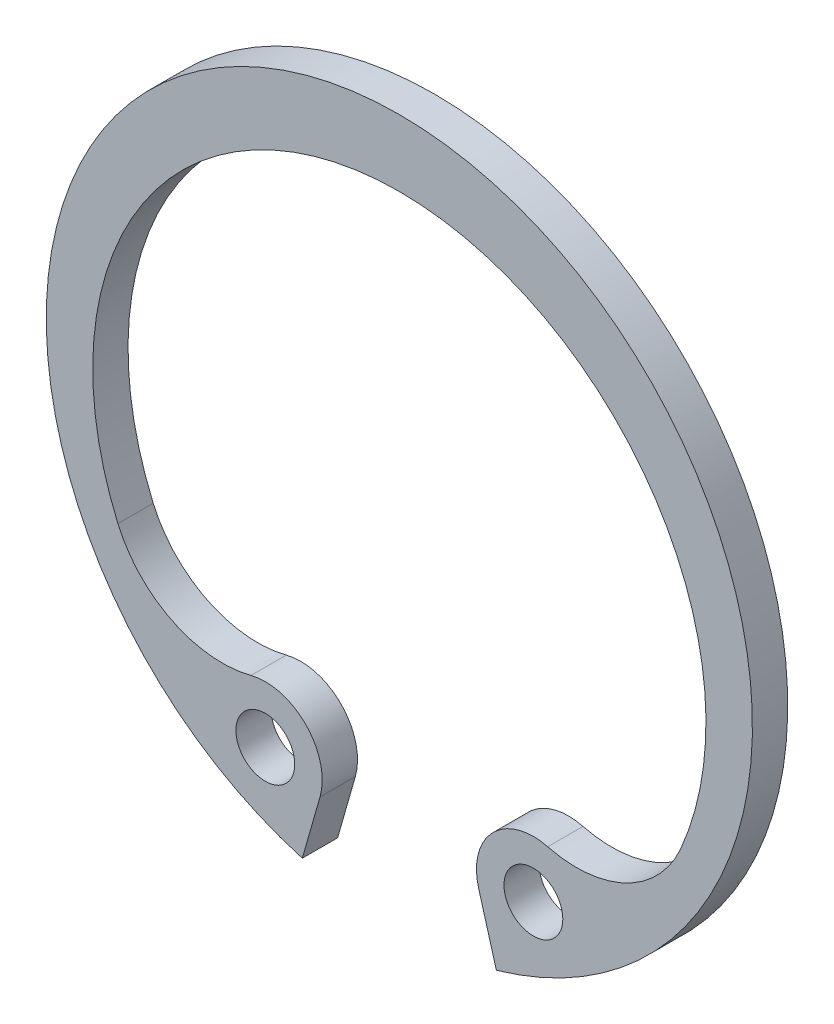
ISO-10303-21;
HEADER;
FILE_DESCRIPTION(('STEP AP214'),'2;1');
FILE_NAME('part.step','',(''),(''),'','','');
FILE_SCHEMA(('AUTOMOTIVE_DESIGN { 1 0 10303 214 1 1 1 1 }'));
ENDSEC;
DATA;
#1=APPLICATION_CONTEXT('core data for automotive mechanical design processes');
#2=APPLICATION_PROTOCOL_DEFINITION('international standard','automotive_design',2000,#1);
#3=PRODUCT_CONTEXT('',#1,'mechanical');
#4=PRODUCT('Part','Part','',(#3));
#5=PRODUCT_RELATED_PRODUCT_CATEGORY('part','',(#4));
#6=PRODUCT_DEFINITION_FORMATION('','',#4);
#7=PRODUCT_DEFINITION_CONTEXT('part definition',#1,'design');
#8=PRODUCT_DEFINITION('design','',#6,#7);
#9=PRODUCT_DEFINITION_SHAPE('','',#8);
#10=(LENGTH_UNIT() NAMED_UNIT(*) SI_UNIT(.MILLI.,.METRE.));
#11=(NAMED_UNIT(*) PLANE_ANGLE_UNIT() SI_UNIT($,.RADIAN.));
#12=(NAMED_UNIT(*) SI_UNIT($,.STERADIAN.) SOLID_ANGLE_UNIT());
#13=UNCERTAINTY_MEASURE_WITH_UNIT(LENGTH_MEASURE(1.E-05),#10,'distance_accuracy_value','');
#14=(GEOMETRIC_REPRESENTATION_CONTEXT(3) GLOBAL_UNCERTAINTY_ASSIGNED_CONTEXT((#13)) GLOBAL_UNIT_ASSIGNED_CONTEXT((#10,
#11,#12)) REPRESENTATION_CONTEXT('',''));
#15=CARTESIAN_POINT('',(0.,0.,0.));
#16=DIRECTION('',(0.,0.,1.));
#17=DIRECTION('',(1.,0.,0.));
#18=AXIS2_PLACEMENT_3D('',#15,#16,#17);
#19=CARTESIAN_POINT('',(0.,0.,-0.900000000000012));
#20=DIRECTION('',(0.,0.,1.));
#21=DIRECTION('',(1.,0.,0.));
#22=AXIS2_PLACEMENT_3D('',#19,#20,#21);
#23=CYLINDRICAL_SURFACE('',#22,9.);
#24=CARTESIAN_POINT('',(0.,0.,0.));
#25=DIRECTION('',(0.,0.,1.));
#26=DIRECTION('',(1.,0.,0.));
#27=AXIS2_PLACEMENT_3D('',#24,#25,#26);
#28=CIRCLE('',#27,9.);
#29=CARTESIAN_POINT('',(2.47318552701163,-8.65351681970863,0.));
#30=VERTEX_POINT('',#29);
#31=CARTESIAN_POINT('',(-2.47318552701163,-8.65351681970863,0.));
#32=VERTEX_POINT('',#31);
#33=EDGE_CURVE('E98',#30,#32,#28,.T.);
#34=ORIENTED_EDGE('',*,*,#33,.F.);
#35=DIRECTION('',(0.,0.,1.));
#36=VECTOR('',#35,1.);
#37=CARTESIAN_POINT('',(2.47318552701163,-8.65351681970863,-0.900000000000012));
#38=LINE('',#37,#36);
#39=CARTESIAN_POINT('',(2.47318552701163,-8.65351681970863,-0.900000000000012));
#40=VERTEX_POINT('',#39);
#41=EDGE_CURVE('E11',#40,#30,#38,.T.);
#42=ORIENTED_EDGE('',*,*,#41,.F.);
#43=CARTESIAN_POINT('',(0.,0.,-0.900000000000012));
#44=DIRECTION('',(0.,0.,1.));
#45=DIRECTION('',(1.,0.,0.));
#46=AXIS2_PLACEMENT_3D('',#43,#44,#45);
#47=CIRCLE('',#46,9.);
#48=CARTESIAN_POINT('',(-2.47318552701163,-8.65351681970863,-0.900000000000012));
#49=VERTEX_POINT('',#48);
#50=EDGE_CURVE('E100',#40,#49,#47,.T.);
#51=ORIENTED_EDGE('',*,*,#50,.T.);
#52=DIRECTION('',(0.,0.,1.));
#53=VECTOR('',#52,1.);
#54=CARTESIAN_POINT('',(-2.47318552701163,-8.65351681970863,-0.900000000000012));
#55=LINE('',#54,#53);
#56=EDGE_CURVE('E37',#49,#32,#55,.T.);
#57=ORIENTED_EDGE('',*,*,#56,.T.);
#58=EDGE_LOOP('',(#34,#42,#51,#57));
#59=FACE_BOUND('',#58,.T.);
#60=ADVANCED_FACE('F34',(#59),#23,.T.);
#61=CARTESIAN_POINT('',(2.47318552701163,-8.65351681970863,-0.900000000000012));
#62=DIRECTION('',(-0.961501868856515,-0.274798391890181,0.));
#63=DIRECTION('',(0.274798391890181,-0.961501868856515,0.));
#64=AXIS2_PLACEMENT_3D('',#61,#62,#63);
#65=PLANE('',#64);
#66=DIRECTION('',(0.274798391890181,-0.961501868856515,0.));
#67=VECTOR('',#66,1.);
#68=CARTESIAN_POINT('',(2.47318552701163,-8.65351681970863,0.));
#69=LINE('',#68,#67);
#70=CARTESIAN_POINT('',(2.02210355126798,-7.07521004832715,0.));
#71=VERTEX_POINT('',#70);
#72=EDGE_CURVE('E116',#71,#30,#69,.T.);
#73=ORIENTED_EDGE('',*,*,#72,.F.);
#74=DIRECTION('',(0.,0.,1.));
#75=VECTOR('',#74,1.);
#76=CARTESIAN_POINT('',(2.02210355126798,-7.07521004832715,-0.900000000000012));
#77=LINE('',#76,#75);
#78=CARTESIAN_POINT('',(2.02210355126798,-7.07521004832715,-0.900000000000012));
#79=VERTEX_POINT('',#78);
#80=EDGE_CURVE('E42',#79,#71,#77,.T.);
#81=ORIENTED_EDGE('',*,*,#80,.F.);
#82=DIRECTION('',(0.274798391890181,-0.961501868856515,0.));
#83=VECTOR('',#82,1.);
#84=CARTESIAN_POINT('',(2.47318552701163,-8.65351681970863,-0.900000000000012));
#85=LINE('',#84,#83);
#86=EDGE_CURVE('E105',#79,#40,#85,.T.);
#87=ORIENTED_EDGE('',*,*,#86,.T.);
#88=ORIENTED_EDGE('',*,*,#41,.T.);
#89=EDGE_LOOP('',(#73,#81,#87,#88));
#90=FACE_BOUND('',#89,.T.);
#91=ADVANCED_FACE('F182',(#90),#65,.T.);
#92=CARTESIAN_POINT('',(3.41628126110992,-6.67675238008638,-0.900000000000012));
#93=DIRECTION('',(0.,0.,1.));
#94=DIRECTION('',(1.,0.,0.));
#95=AXIS2_PLACEMENT_3D('',#92,#93,#94);
#96=CYLINDRICAL_SURFACE('',#95,1.45);
#97=CARTESIAN_POINT('',(3.41628126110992,-6.67675238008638,0.));
#98=DIRECTION('',(0.,0.,1.));
#99=DIRECTION('',(1.,0.,0.));
#100=AXIS2_PLACEMENT_3D('',#97,#98,#99);
#101=CIRCLE('',#100,1.45);
#102=CARTESIAN_POINT('',(3.78146677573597,-5.27349205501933,0.));
#103=VERTEX_POINT('',#102);
#104=EDGE_CURVE('E134',#103,#71,#101,.T.);
#105=ORIENTED_EDGE('',*,*,#104,.F.);
#106=DIRECTION('',(0.,0.,1.));
#107=VECTOR('',#106,1.);
#108=CARTESIAN_POINT('',(3.78146677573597,-5.27349205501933,-0.900000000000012));
#109=LINE('',#108,#107);
#110=CARTESIAN_POINT('',(3.78146677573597,-5.27349205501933,-0.900000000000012));
#111=VERTEX_POINT('',#110);
#112=EDGE_CURVE('E156',#111,#103,#109,.T.);
#113=ORIENTED_EDGE('',*,*,#112,.F.);
#114=CARTESIAN_POINT('',(3.41628126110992,-6.67675238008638,-0.900000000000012));
#115=DIRECTION('',(0.,0.,1.));
#116=DIRECTION('',(1.,0.,0.));
#117=AXIS2_PLACEMENT_3D('',#114,#115,#116);
#118=CIRCLE('',#117,1.45);
#119=EDGE_CURVE('E152',#111,#79,#118,.T.);
#120=ORIENTED_EDGE('',*,*,#119,.T.);
#121=ORIENTED_EDGE('',*,*,#80,.T.);
#122=EDGE_LOOP('',(#105,#113,#120,#121));
#123=FACE_BOUND('',#122,.T.);
#124=ADVANCED_FACE('F181',(#123),#96,.T.);
#125=CARTESIAN_POINT('',(4.51183780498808,-2.46697140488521,-0.900000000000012));
#126=DIRECTION('',(0.,0.,1.));
#127=DIRECTION('',(1.,0.,0.));
#128=AXIS2_PLACEMENT_3D('',#125,#126,#127);
#129=CYLINDRICAL_SURFACE('',#128,2.9);
#130=CARTESIAN_POINT('',(4.51183780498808,-2.46697140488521,0.));
#131=DIRECTION('',(0.,0.,-1.));
#132=DIRECTION('',(1.,0.,0.));
#133=AXIS2_PLACEMENT_3D('',#130,#131,#132);
#134=CIRCLE('',#133,2.9);
#135=CARTESIAN_POINT('',(7.17357937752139,-3.61811509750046,0.));
#136=VERTEX_POINT('',#135);
#137=EDGE_CURVE('E131',#136,#103,#134,.T.);
#138=ORIENTED_EDGE('',*,*,#137,.F.);
#139=DIRECTION('',(0.,0.,1.));
#140=VECTOR('',#139,1.);
#141=CARTESIAN_POINT('',(7.17357937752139,-3.61811509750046,-0.900000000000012));
#142=LINE('',#141,#140);
#143=CARTESIAN_POINT('',(7.17357937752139,-3.61811509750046,-0.900000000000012));
#144=VERTEX_POINT('',#143);
#145=EDGE_CURVE('E158',#144,#136,#142,.T.);
#146=ORIENTED_EDGE('',*,*,#145,.F.);
#147=CARTESIAN_POINT('',(4.51183780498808,-2.46697140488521,-0.900000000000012));
#148=DIRECTION('',(0.,0.,-1.));
#149=DIRECTION('',(1.,0.,0.));
#150=AXIS2_PLACEMENT_3D('',#147,#148,#149);
#151=CIRCLE('',#150,2.9);
#152=EDGE_CURVE('E149',#144,#111,#151,.T.);
#153=ORIENTED_EDGE('',*,*,#152,.T.);
#154=ORIENTED_EDGE('',*,*,#112,.T.);
#155=EDGE_LOOP('',(#138,#146,#153,#154));
#156=FACE_BOUND('',#155,.T.);
#157=ADVANCED_FACE('F177',(#156),#129,.F.);
#158=CARTESIAN_POINT('',(0.,-0.515702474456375,-0.900000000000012));
#159=DIRECTION('',(0.,0.,1.));
#160=DIRECTION('',(1.,0.,0.));
#161=AXIS2_PLACEMENT_3D('',#158,#159,#160);
#162=CYLINDRICAL_SURFACE('',#161,7.81570247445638);
#163=CARTESIAN_POINT('',(0.,-0.515702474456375,0.));
#164=DIRECTION('',(0.,0.,-1.));
#165=DIRECTION('',(1.,0.,0.));
#166=AXIS2_PLACEMENT_3D('',#163,#164,#165);
#167=CIRCLE('',#166,7.81570247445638);
#168=CARTESIAN_POINT('',(-7.1735793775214,-3.61811509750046,0.));
#169=VERTEX_POINT('',#168);
#170=EDGE_CURVE('E128',#169,#136,#167,.T.);
#171=ORIENTED_EDGE('',*,*,#170,.F.);
#172=DIRECTION('',(0.,0.,1.));
#173=VECTOR('',#172,1.);
#174=CARTESIAN_POINT('',(-7.1735793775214,-3.61811509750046,-0.900000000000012));
#175=LINE('',#174,#173);
#176=CARTESIAN_POINT('',(-7.1735793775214,-3.61811509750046,-0.900000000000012));
#177=VERTEX_POINT('',#176);
#178=EDGE_CURVE('E160',#177,#169,#175,.T.);
#179=ORIENTED_EDGE('',*,*,#178,.F.);
#180=CARTESIAN_POINT('',(0.,-0.515702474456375,-0.900000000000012));
#181=DIRECTION('',(0.,0.,-1.));
#182=DIRECTION('',(1.,0.,0.));
#183=AXIS2_PLACEMENT_3D('',#180,#181,#182);
#184=CIRCLE('',#183,7.81570247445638);
#185=EDGE_CURVE('E146',#177,#144,#184,.T.);
#186=ORIENTED_EDGE('',*,*,#185,.T.);
#187=ORIENTED_EDGE('',*,*,#145,.T.);
#188=EDGE_LOOP('',(#171,#179,#186,#187));
#189=FACE_BOUND('',#188,.T.);
#190=ADVANCED_FACE('F173',(#189),#162,.F.);
#191=CARTESIAN_POINT('',(-4.51183780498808,-2.46697140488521,-0.900000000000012));
#192=DIRECTION('',(0.,0.,1.));
#193=DIRECTION('',(1.,0.,0.));
#194=AXIS2_PLACEMENT_3D('',#191,#192,#193);
#195=CYLINDRICAL_SURFACE('',#194,2.9);
#196=CARTESIAN_POINT('',(-4.51183780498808,-2.46697140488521,0.));
#197=DIRECTION('',(0.,0.,-1.));
#198=DIRECTION('',(1.,0.,0.));
#199=AXIS2_PLACEMENT_3D('',#196,#197,#198);
#200=CIRCLE('',#199,2.9);
#201=CARTESIAN_POINT('',(-3.78146677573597,-5.27349205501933,0.));
#202=VERTEX_POINT('',#201);
#203=EDGE_CURVE('E125',#202,#169,#200,.T.);
#204=ORIENTED_EDGE('',*,*,#203,.F.);
#205=DIRECTION('',(0.,0.,1.));
#206=VECTOR('',#205,1.);
#207=CARTESIAN_POINT('',(-3.78146677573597,-5.27349205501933,-0.900000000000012));
#208=LINE('',#207,#206);
#209=CARTESIAN_POINT('',(-3.78146677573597,-5.27349205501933,-0.900000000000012));
#210=VERTEX_POINT('',#209);
#211=EDGE_CURVE('E162',#210,#202,#208,.T.);
#212=ORIENTED_EDGE('',*,*,#211,.F.);
#213=CARTESIAN_POINT('',(-4.51183780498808,-2.46697140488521,-0.900000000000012));
#214=DIRECTION('',(0.,0.,-1.));
#215=DIRECTION('',(1.,0.,0.));
#216=AXIS2_PLACEMENT_3D('',#213,#214,#215);
#217=CIRCLE('',#216,2.9);
#218=EDGE_CURVE('E143',#210,#177,#217,.T.);
#219=ORIENTED_EDGE('',*,*,#218,.T.);
#220=ORIENTED_EDGE('',*,*,#178,.T.);
#221=EDGE_LOOP('',(#204,#212,#219,#220));
#222=FACE_BOUND('',#221,.T.);
#223=ADVANCED_FACE('F169',(#222),#195,.F.);
#224=CARTESIAN_POINT('',(-3.41628126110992,-6.67675238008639,-0.900000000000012));
#225=DIRECTION('',(0.,0.,1.));
#226=DIRECTION('',(1.,0.,0.));
#227=AXIS2_PLACEMENT_3D('',#224,#225,#226);
#228=CYLINDRICAL_SURFACE('',#227,1.45);
#229=CARTESIAN_POINT('',(-3.41628126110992,-6.67675238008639,0.));
#230=DIRECTION('',(0.,0.,1.));
#231=DIRECTION('',(1.,0.,0.));
#232=AXIS2_PLACEMENT_3D('',#229,#230,#231);
#233=CIRCLE('',#232,1.45);
#234=CARTESIAN_POINT('',(-2.02210355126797,-7.07521004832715,0.));
#235=VERTEX_POINT('',#234);
#236=EDGE_CURVE('E112',#235,#202,#233,.T.);
#237=ORIENTED_EDGE('',*,*,#236,.F.);
#238=DIRECTION('',(0.,0.,1.));
#239=VECTOR('',#238,1.);
#240=CARTESIAN_POINT('',(-2.02210355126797,-7.07521004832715,-0.900000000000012));
#241=LINE('',#240,#239);
#242=CARTESIAN_POINT('',(-2.02210355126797,-7.07521004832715,-0.900000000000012));
#243=VERTEX_POINT('',#242);
#244=EDGE_CURVE('E104',#243,#235,#241,.T.);
#245=ORIENTED_EDGE('',*,*,#244,.F.);
#246=CARTESIAN_POINT('',(-3.41628126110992,-6.67675238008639,-0.900000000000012));
#247=DIRECTION('',(0.,0.,1.));
#248=DIRECTION('',(1.,0.,0.));
#249=AXIS2_PLACEMENT_3D('',#246,#247,#248);
#250=CIRCLE('',#249,1.45);
#251=EDGE_CURVE('E140',#243,#210,#250,.T.);
#252=ORIENTED_EDGE('',*,*,#251,.T.);
#253=ORIENTED_EDGE('',*,*,#211,.T.);
#254=EDGE_LOOP('',(#237,#245,#252,#253));
#255=FACE_BOUND('',#254,.T.);
#256=ADVANCED_FACE('F165',(#255),#228,.T.);
#257=CARTESIAN_POINT('',(-2.47318552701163,-8.65351681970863,-0.900000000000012));
#258=DIRECTION('',(0.961501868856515,-0.274798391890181,0.));
#259=DIRECTION('',(0.274798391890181,0.961501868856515,0.));
#260=AXIS2_PLACEMENT_3D('',#257,#258,#259);
#261=PLANE('',#260);
#262=DIRECTION('',(0.274798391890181,0.961501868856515,0.));
#263=VECTOR('',#262,1.);
#264=CARTESIAN_POINT('',(-2.47318552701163,-8.65351681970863,0.));
#265=LINE('',#264,#263);
#266=EDGE_CURVE('E107',#32,#235,#265,.T.);
#267=ORIENTED_EDGE('',*,*,#266,.F.);
#268=ORIENTED_EDGE('',*,*,#56,.F.);
#269=DIRECTION('',(0.274798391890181,0.961501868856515,0.));
#270=VECTOR('',#269,1.);
#271=CARTESIAN_POINT('',(-2.47318552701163,-8.65351681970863,-0.900000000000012));
#272=LINE('',#271,#270);
#273=EDGE_CURVE('E138',#49,#243,#272,.T.);
#274=ORIENTED_EDGE('',*,*,#273,.T.);
#275=ORIENTED_EDGE('',*,*,#244,.T.);
#276=EDGE_LOOP('',(#267,#268,#274,#275));
#277=FACE_BOUND('',#276,.T.);
#278=ADVANCED_FACE('F108',(#277),#261,.T.);
#279=CARTESIAN_POINT('',(0.,0.,-0.900000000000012));
#280=DIRECTION('',(0.,0.,1.));
#281=DIRECTION('',(1.,0.,0.));
#282=AXIS2_PLACEMENT_3D('',#279,#280,#281);
#283=PLANE('',#282);
#284=CARTESIAN_POINT('',(-3.41628126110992,-6.67675238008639,-0.900000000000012));
#285=DIRECTION('',(0.,0.,1.));
#286=DIRECTION('',(1.,0.,0.));
#287=AXIS2_PLACEMENT_3D('',#284,#285,#286);
#288=CIRCLE('',#287,0.750000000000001);
#289=CARTESIAN_POINT('',(-2.66628126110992,-6.67675238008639,-0.900000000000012));
#290=VERTEX_POINT('',#289);
#291=EDGE_CURVE('E248',#290,#290,#288,.T.);
#292=ORIENTED_EDGE('',*,*,#291,.T.);
#293=EDGE_LOOP('',(#292));
#294=FACE_BOUND('',#293,.T.);
#295=CARTESIAN_POINT('',(3.41628126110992,-6.67675238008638,-0.900000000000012));
#296=DIRECTION('',(0.,0.,1.));
#297=DIRECTION('',(1.,0.,0.));
#298=AXIS2_PLACEMENT_3D('',#295,#296,#297);
#299=CIRCLE('',#298,0.749999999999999);
#300=CARTESIAN_POINT('',(4.16628126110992,-6.67675238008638,-0.900000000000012));
#301=VERTEX_POINT('',#300);
#302=EDGE_CURVE('E117',#301,#301,#299,.T.);
#303=ORIENTED_EDGE('',*,*,#302,.T.);
#304=EDGE_LOOP('',(#303));
#305=FACE_BOUND('',#304,.T.);
#306=ORIENTED_EDGE('',*,*,#50,.F.);
#307=ORIENTED_EDGE('',*,*,#86,.F.);
#308=ORIENTED_EDGE('',*,*,#119,.F.);
#309=ORIENTED_EDGE('',*,*,#152,.F.);
#310=ORIENTED_EDGE('',*,*,#185,.F.);
#311=ORIENTED_EDGE('',*,*,#218,.F.);
#312=ORIENTED_EDGE('',*,*,#251,.F.);
#313=ORIENTED_EDGE('',*,*,#273,.F.);
#314=EDGE_LOOP('',(#306,#307,#308,#309,#310,#311,#312,#313));
#315=FACE_BOUND('',#314,.T.);
#316=ADVANCED_FACE('F185',(#294,#305,#315),#283,.F.);
#317=CARTESIAN_POINT('',(0.,0.,0.));
#318=DIRECTION('',(0.,0.,1.));
#319=DIRECTION('',(1.,0.,0.));
#320=AXIS2_PLACEMENT_3D('',#317,#318,#319);
#321=PLANE('',#320);
#322=CARTESIAN_POINT('',(-3.41628126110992,-6.67675238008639,0.));
#323=DIRECTION('',(0.,0.,1.));
#324=DIRECTION('',(1.,0.,0.));
#325=AXIS2_PLACEMENT_3D('',#322,#323,#324);
#326=CIRCLE('',#325,0.750000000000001);
#327=CARTESIAN_POINT('',(-2.66628126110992,-6.67675238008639,0.));
#328=VERTEX_POINT('',#327);
#329=EDGE_CURVE('E251',#328,#328,#326,.T.);
#330=ORIENTED_EDGE('',*,*,#329,.F.);
#331=EDGE_LOOP('',(#330));
#332=FACE_BOUND('',#331,.T.);
#333=CARTESIAN_POINT('',(3.41628126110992,-6.67675238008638,0.));
#334=DIRECTION('',(0.,0.,1.));
#335=DIRECTION('',(1.,0.,0.));
#336=AXIS2_PLACEMENT_3D('',#333,#334,#335);
#337=CIRCLE('',#336,0.749999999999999);
#338=CARTESIAN_POINT('',(4.16628126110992,-6.67675238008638,0.));
#339=VERTEX_POINT('',#338);
#340=EDGE_CURVE('E120',#339,#339,#337,.T.);
#341=ORIENTED_EDGE('',*,*,#340,.F.);
#342=EDGE_LOOP('',(#341));
#343=FACE_BOUND('',#342,.T.);
#344=ORIENTED_EDGE('',*,*,#33,.T.);
#345=ORIENTED_EDGE('',*,*,#266,.T.);
#346=ORIENTED_EDGE('',*,*,#236,.T.);
#347=ORIENTED_EDGE('',*,*,#203,.T.);
#348=ORIENTED_EDGE('',*,*,#170,.T.);
#349=ORIENTED_EDGE('',*,*,#137,.T.);
#350=ORIENTED_EDGE('',*,*,#104,.T.);
#351=ORIENTED_EDGE('',*,*,#72,.T.);
#352=EDGE_LOOP('',(#344,#345,#346,#347,#348,#349,#350,#351));
#353=FACE_BOUND('',#352,.T.);
#354=ADVANCED_FACE('F114',(#332,#343,#353),#321,.T.);
#355=CARTESIAN_POINT('',(3.41628126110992,-6.67675238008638,-0.900000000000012));
#356=DIRECTION('',(0.,0.,1.));
#357=DIRECTION('',(1.,0.,0.));
#358=AXIS2_PLACEMENT_3D('',#355,#356,#357);
#359=CYLINDRICAL_SURFACE('',#358,0.749999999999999);
#360=ORIENTED_EDGE('',*,*,#302,.F.);
#361=EDGE_LOOP('',(#360));
#362=FACE_BOUND('',#361,.T.);
#363=ORIENTED_EDGE('',*,*,#340,.T.);
#364=EDGE_LOOP('',(#363));
#365=FACE_BOUND('',#364,.T.);
#366=ADVANCED_FACE('F193',(#362,#365),#359,.F.);
#367=CARTESIAN_POINT('',(-3.41628126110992,-6.67675238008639,-0.900000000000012));
#368=DIRECTION('',(0.,0.,1.));
#369=DIRECTION('',(1.,0.,0.));
#370=AXIS2_PLACEMENT_3D('',#367,#368,#369);
#371=CYLINDRICAL_SURFACE('',#370,0.750000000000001);
#372=ORIENTED_EDGE('',*,*,#291,.F.);
#373=EDGE_LOOP('',(#372));
#374=FACE_BOUND('',#373,.T.);
#375=ORIENTED_EDGE('',*,*,#329,.T.);
#376=EDGE_LOOP('',(#375));
#377=FACE_BOUND('',#376,.T.);
#378=ADVANCED_FACE('F236',(#374,#377),#371,.F.);
#379=CLOSED_SHELL('',(#60,#91,#124,#157,#190,#223,#256,#278,#316,#354,#366,#378));
#380=MANIFOLD_SOLID_BREP('B2',#379);
#381=ADVANCED_BREP_SHAPE_REPRESENTATION('',(#18,#380),#14);
#382=SHAPE_DEFINITION_REPRESENTATION(#9,#381);
ENDSEC;
END-ISO-10303-21;
